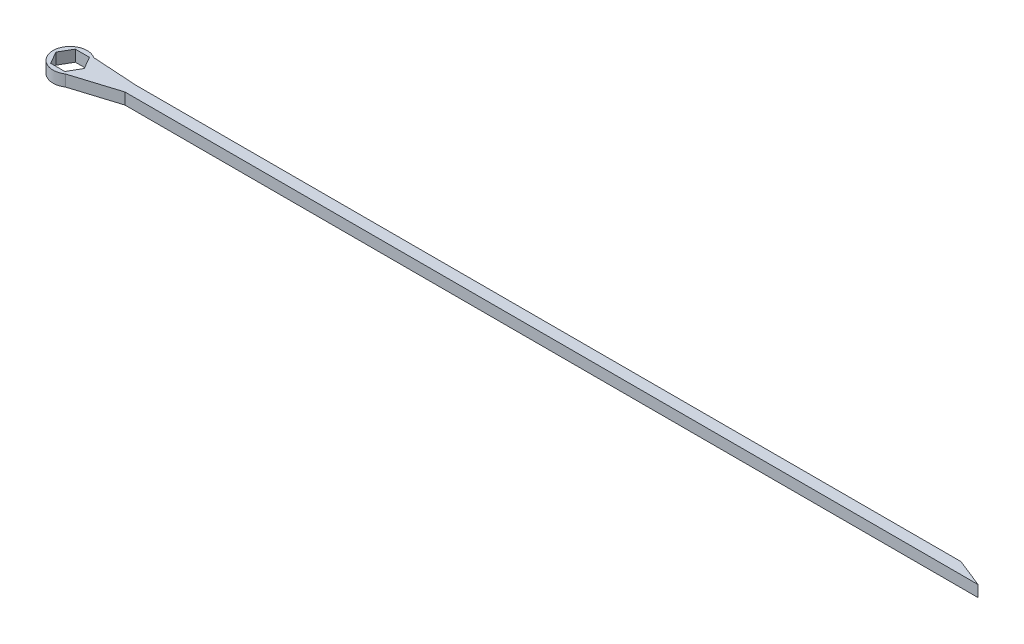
ISO-10303-21;
HEADER;
FILE_DESCRIPTION(('STEP AP214'),'2;1');
FILE_NAME('part.step','',(''),(''),'','','');
FILE_SCHEMA(('AUTOMOTIVE_DESIGN { 1 0 10303 214 1 1 1 1 }'));
ENDSEC;
DATA;
#1=APPLICATION_CONTEXT('core data for automotive mechanical design processes');
#2=APPLICATION_PROTOCOL_DEFINITION('international standard','automotive_design',2000,#1);
#3=PRODUCT_CONTEXT('',#1,'mechanical');
#4=PRODUCT('Part','Part','',(#3));
#5=PRODUCT_RELATED_PRODUCT_CATEGORY('part','',(#4));
#6=PRODUCT_DEFINITION_FORMATION('','',#4);
#7=PRODUCT_DEFINITION_CONTEXT('part definition',#1,'design');
#8=PRODUCT_DEFINITION('design','',#6,#7);
#9=PRODUCT_DEFINITION_SHAPE('','',#8);
#10=(LENGTH_UNIT() NAMED_UNIT(*) SI_UNIT(.MILLI.,.METRE.));
#11=(NAMED_UNIT(*) PLANE_ANGLE_UNIT() SI_UNIT($,.RADIAN.));
#12=(NAMED_UNIT(*) SI_UNIT($,.STERADIAN.) SOLID_ANGLE_UNIT());
#13=UNCERTAINTY_MEASURE_WITH_UNIT(LENGTH_MEASURE(1.E-05),#10,'distance_accuracy_value','');
#14=(GEOMETRIC_REPRESENTATION_CONTEXT(3) GLOBAL_UNCERTAINTY_ASSIGNED_CONTEXT((#13)) GLOBAL_UNIT_ASSIGNED_CONTEXT((#10,
#11,#12)) REPRESENTATION_CONTEXT('',''));
#15=CARTESIAN_POINT('',(0.,0.,0.));
#16=DIRECTION('',(0.,0.,1.));
#17=DIRECTION('',(1.,0.,0.));
#18=AXIS2_PLACEMENT_3D('',#15,#16,#17);
#19=CARTESIAN_POINT('',(0.,1.,0.));
#20=DIRECTION('',(0.,1.,0.));
#21=DIRECTION('',(0.,0.,1.));
#22=AXIS2_PLACEMENT_3D('',#19,#20,#21);
#23=PLANE('',#22);
#24=DIRECTION('',(0.95447997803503,0.,-0.298274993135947));
#25=VECTOR('',#24,1.);
#26=CARTESIAN_POINT('',(4.82915619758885,1.,0.));
#27=LINE('',#26,#25);
#28=CARTESIAN_POINT('',(0.82915619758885,1.,1.25));
#29=VERTEX_POINT('',#28);
#30=CARTESIAN_POINT('',(4.82915619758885,1.,0.));
#31=VERTEX_POINT('',#30);
#32=EDGE_CURVE('E172',#29,#31,#27,.T.);
#33=ORIENTED_EDGE('',*,*,#32,.T.);
#34=DIRECTION('',(1.,0.,0.));
#35=VECTOR('',#34,1.);
#36=CARTESIAN_POINT('',(4.82915619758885,1.,0.));
#37=LINE('',#36,#35);
#38=CARTESIAN_POINT('',(80.,1.,0.));
#39=VERTEX_POINT('',#38);
#40=EDGE_CURVE('E175',#31,#39,#37,.T.);
#41=ORIENTED_EDGE('',*,*,#40,.T.);
#42=DIRECTION('',(-0.928476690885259,0.,-0.371390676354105));
#43=VECTOR('',#42,1.);
#44=CARTESIAN_POINT('',(80.,1.,0.));
#45=LINE('',#44,#43);
#46=CARTESIAN_POINT('',(77.5,1.,-1.00000000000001));
#47=VERTEX_POINT('',#46);
#48=EDGE_CURVE('E178',#39,#47,#45,.T.);
#49=ORIENTED_EDGE('',*,*,#48,.T.);
#50=DIRECTION('',(-1.,0.,0.));
#51=VECTOR('',#50,1.);
#52=CARTESIAN_POINT('',(77.5,1.,-1.00000000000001));
#53=LINE('',#52,#51);
#54=CARTESIAN_POINT('',(4.82915619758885,1.,-0.999999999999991));
#55=VERTEX_POINT('',#54);
#56=EDGE_CURVE('E180',#47,#55,#53,.T.);
#57=ORIENTED_EDGE('',*,*,#56,.T.);
#58=DIRECTION('',(-0.998052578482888,0.,-0.0623782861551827));
#59=VECTOR('',#58,1.);
#60=CARTESIAN_POINT('',(4.82915619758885,1.,-0.999999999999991));
#61=LINE('',#60,#59);
#62=CARTESIAN_POINT('',(0.82915619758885,1.,-1.25));
#63=VERTEX_POINT('',#62);
#64=EDGE_CURVE('E182',#55,#63,#61,.T.);
#65=ORIENTED_EDGE('',*,*,#64,.T.);
#66=CARTESIAN_POINT('',(0.,1.,0.));
#67=DIRECTION('',(0.,1.,0.));
#68=DIRECTION('',(0.,0.,1.));
#69=AXIS2_PLACEMENT_3D('',#66,#67,#68);
#70=CIRCLE('',#69,1.5);
#71=EDGE_CURVE('E184',#63,#29,#70,.T.);
#72=ORIENTED_EDGE('',*,*,#71,.T.);
#73=EDGE_LOOP('',(#33,#41,#49,#57,#65,#72));
#74=FACE_BOUND('',#73,.T.);
#75=DIRECTION('',(-0.5,0.,-0.866025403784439));
#76=VECTOR('',#75,1.);
#77=CARTESIAN_POINT('',(1.25,1.,0.));
#78=LINE('',#77,#76);
#79=CARTESIAN_POINT('',(1.25,1.,0.));
#80=VERTEX_POINT('',#79);
#81=CARTESIAN_POINT('',(0.625,1.,-1.08253175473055));
#82=VERTEX_POINT('',#81);
#83=EDGE_CURVE('E129',#80,#82,#78,.T.);
#84=ORIENTED_EDGE('',*,*,#83,.F.);
#85=DIRECTION('',(0.5,0.,-0.866025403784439));
#86=VECTOR('',#85,1.);
#87=CARTESIAN_POINT('',(0.625,1.,1.08253175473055));
#88=LINE('',#87,#86);
#89=CARTESIAN_POINT('',(0.625,1.,1.08253175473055));
#90=VERTEX_POINT('',#89);
#91=EDGE_CURVE('E121',#90,#80,#88,.T.);
#92=ORIENTED_EDGE('',*,*,#91,.F.);
#93=DIRECTION('',(1.,0.,0.));
#94=VECTOR('',#93,1.);
#95=CARTESIAN_POINT('',(-0.625000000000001,1.,1.08253175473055));
#96=LINE('',#95,#94);
#97=CARTESIAN_POINT('',(-0.625000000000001,1.,1.08253175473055));
#98=VERTEX_POINT('',#97);
#99=EDGE_CURVE('E150',#98,#90,#96,.T.);
#100=ORIENTED_EDGE('',*,*,#99,.F.);
#101=DIRECTION('',(0.5,0.,0.866025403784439));
#102=VECTOR('',#101,1.);
#103=CARTESIAN_POINT('',(-1.25,1.,0.));
#104=LINE('',#103,#102);
#105=CARTESIAN_POINT('',(-1.25,1.,0.));
#106=VERTEX_POINT('',#105);
#107=EDGE_CURVE('E148',#106,#98,#104,.T.);
#108=ORIENTED_EDGE('',*,*,#107,.F.);
#109=DIRECTION('',(-0.5,0.,0.866025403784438));
#110=VECTOR('',#109,1.);
#111=CARTESIAN_POINT('',(-0.625,1.,-1.08253175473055));
#112=LINE('',#111,#110);
#113=CARTESIAN_POINT('',(-0.625,1.,-1.08253175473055));
#114=VERTEX_POINT('',#113);
#115=EDGE_CURVE('E144',#114,#106,#112,.T.);
#116=ORIENTED_EDGE('',*,*,#115,.F.);
#117=DIRECTION('',(-1.,0.,0.));
#118=VECTOR('',#117,1.);
#119=CARTESIAN_POINT('',(0.625,1.,-1.08253175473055));
#120=LINE('',#119,#118);
#121=EDGE_CURVE('E142',#82,#114,#120,.T.);
#122=ORIENTED_EDGE('',*,*,#121,.F.);
#123=EDGE_LOOP('',(#84,#92,#100,#108,#116,#122));
#124=FACE_BOUND('',#123,.T.);
#125=ADVANCED_FACE('F32',(#74,#124),#23,.T.);
#126=CARTESIAN_POINT('',(0.,0.,0.));
#127=DIRECTION('',(0.,1.,0.));
#128=DIRECTION('',(0.,0.,1.));
#129=AXIS2_PLACEMENT_3D('',#126,#127,#128);
#130=PLANE('',#129);
#131=DIRECTION('',(0.95447997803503,0.,-0.298274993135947));
#132=VECTOR('',#131,1.);
#133=CARTESIAN_POINT('',(4.82915619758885,0.,0.));
#134=LINE('',#133,#132);
#135=CARTESIAN_POINT('',(0.82915619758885,0.,1.25));
#136=VERTEX_POINT('',#135);
#137=CARTESIAN_POINT('',(4.82915619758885,0.,0.));
#138=VERTEX_POINT('',#137);
#139=EDGE_CURVE('E137',#136,#138,#134,.T.);
#140=ORIENTED_EDGE('',*,*,#139,.F.);
#141=CARTESIAN_POINT('',(0.,0.,0.));
#142=DIRECTION('',(0.,1.,0.));
#143=DIRECTION('',(0.,0.,1.));
#144=AXIS2_PLACEMENT_3D('',#141,#142,#143);
#145=CIRCLE('',#144,1.5);
#146=CARTESIAN_POINT('',(0.82915619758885,0.,-1.25));
#147=VERTEX_POINT('',#146);
#148=EDGE_CURVE('E176',#147,#136,#145,.T.);
#149=ORIENTED_EDGE('',*,*,#148,.F.);
#150=DIRECTION('',(-0.998052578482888,0.,-0.0623782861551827));
#151=VECTOR('',#150,1.);
#152=CARTESIAN_POINT('',(4.82915619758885,0.,-0.999999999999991));
#153=LINE('',#152,#151);
#154=CARTESIAN_POINT('',(4.82915619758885,0.,-0.999999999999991));
#155=VERTEX_POINT('',#154);
#156=EDGE_CURVE('E195',#155,#147,#153,.T.);
#157=ORIENTED_EDGE('',*,*,#156,.F.);
#158=DIRECTION('',(-1.,0.,0.));
#159=VECTOR('',#158,1.);
#160=CARTESIAN_POINT('',(77.5,0.,-1.00000000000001));
#161=LINE('',#160,#159);
#162=CARTESIAN_POINT('',(77.5,0.,-1.00000000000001));
#163=VERTEX_POINT('',#162);
#164=EDGE_CURVE('E193',#163,#155,#161,.T.);
#165=ORIENTED_EDGE('',*,*,#164,.F.);
#166=DIRECTION('',(-0.928476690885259,0.,-0.371390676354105));
#167=VECTOR('',#166,1.);
#168=CARTESIAN_POINT('',(80.,0.,0.));
#169=LINE('',#168,#167);
#170=CARTESIAN_POINT('',(80.,0.,0.));
#171=VERTEX_POINT('',#170);
#172=EDGE_CURVE('E191',#171,#163,#169,.T.);
#173=ORIENTED_EDGE('',*,*,#172,.F.);
#174=DIRECTION('',(1.,0.,0.));
#175=VECTOR('',#174,1.);
#176=CARTESIAN_POINT('',(4.82915619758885,0.,0.));
#177=LINE('',#176,#175);
#178=EDGE_CURVE('E189',#138,#171,#177,.T.);
#179=ORIENTED_EDGE('',*,*,#178,.F.);
#180=EDGE_LOOP('',(#140,#149,#157,#165,#173,#179));
#181=FACE_BOUND('',#180,.T.);
#182=DIRECTION('',(0.5,0.,-0.866025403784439));
#183=VECTOR('',#182,1.);
#184=CARTESIAN_POINT('',(0.625,0.,1.08253175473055));
#185=LINE('',#184,#183);
#186=CARTESIAN_POINT('',(0.625,0.,1.08253175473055));
#187=VERTEX_POINT('',#186);
#188=CARTESIAN_POINT('',(1.25,0.,0.));
#189=VERTEX_POINT('',#188);
#190=EDGE_CURVE('E55',#187,#189,#185,.T.);
#191=ORIENTED_EDGE('',*,*,#190,.T.);
#192=DIRECTION('',(-0.5,0.,-0.866025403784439));
#193=VECTOR('',#192,1.);
#194=CARTESIAN_POINT('',(1.25,0.,0.));
#195=LINE('',#194,#193);
#196=CARTESIAN_POINT('',(0.625,0.,-1.08253175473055));
#197=VERTEX_POINT('',#196);
#198=EDGE_CURVE('E136',#189,#197,#195,.T.);
#199=ORIENTED_EDGE('',*,*,#198,.T.);
#200=DIRECTION('',(-1.,0.,0.));
#201=VECTOR('',#200,1.);
#202=CARTESIAN_POINT('',(0.625,0.,-1.08253175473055));
#203=LINE('',#202,#201);
#204=CARTESIAN_POINT('',(-0.625,0.,-1.08253175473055));
#205=VERTEX_POINT('',#204);
#206=EDGE_CURVE('E154',#197,#205,#203,.T.);
#207=ORIENTED_EDGE('',*,*,#206,.T.);
#208=DIRECTION('',(-0.5,0.,0.866025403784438));
#209=VECTOR('',#208,1.);
#210=CARTESIAN_POINT('',(-0.625,0.,-1.08253175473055));
#211=LINE('',#210,#209);
#212=CARTESIAN_POINT('',(-1.25,0.,0.));
#213=VERTEX_POINT('',#212);
#214=EDGE_CURVE('E157',#205,#213,#211,.T.);
#215=ORIENTED_EDGE('',*,*,#214,.T.);
#216=DIRECTION('',(0.5,0.,0.866025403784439));
#217=VECTOR('',#216,1.);
#218=CARTESIAN_POINT('',(-1.25,0.,0.));
#219=LINE('',#218,#217);
#220=CARTESIAN_POINT('',(-0.625000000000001,0.,1.08253175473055));
#221=VERTEX_POINT('',#220);
#222=EDGE_CURVE('E160',#213,#221,#219,.T.);
#223=ORIENTED_EDGE('',*,*,#222,.T.);
#224=DIRECTION('',(1.,0.,0.));
#225=VECTOR('',#224,1.);
#226=CARTESIAN_POINT('',(-0.625000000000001,0.,1.08253175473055));
#227=LINE('',#226,#225);
#228=EDGE_CURVE('E130',#221,#187,#227,.T.);
#229=ORIENTED_EDGE('',*,*,#228,.T.);
#230=EDGE_LOOP('',(#191,#199,#207,#215,#223,#229));
#231=FACE_BOUND('',#230,.T.);
#232=ADVANCED_FACE('F219',(#181,#231),#130,.F.);
#233=CARTESIAN_POINT('',(4.82915619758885,1.,0.));
#234=DIRECTION('',(-0.298274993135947,0.,-0.95447997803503));
#235=DIRECTION('',(-0.95447997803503,0.,0.298274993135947));
#236=AXIS2_PLACEMENT_3D('',#233,#234,#235);
#237=PLANE('',#236);
#238=ORIENTED_EDGE('',*,*,#139,.T.);
#239=DIRECTION('',(0.,-1.,0.));
#240=VECTOR('',#239,1.);
#241=CARTESIAN_POINT('',(4.82915619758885,1.,0.));
#242=LINE('',#241,#240);
#243=EDGE_CURVE('E11',#31,#138,#242,.T.);
#244=ORIENTED_EDGE('',*,*,#243,.F.);
#245=ORIENTED_EDGE('',*,*,#32,.F.);
#246=DIRECTION('',(0.,-1.,0.));
#247=VECTOR('',#246,1.);
#248=CARTESIAN_POINT('',(0.82915619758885,1.,1.25));
#249=LINE('',#248,#247);
#250=EDGE_CURVE('E186',#29,#136,#249,.T.);
#251=ORIENTED_EDGE('',*,*,#250,.T.);
#252=EDGE_LOOP('',(#238,#244,#245,#251));
#253=FACE_BOUND('',#252,.T.);
#254=ADVANCED_FACE('F34',(#253),#237,.F.);
#255=CARTESIAN_POINT('',(4.82915619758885,1.,0.));
#256=DIRECTION('',(0.,0.,-1.));
#257=DIRECTION('',(-1.,0.,0.));
#258=AXIS2_PLACEMENT_3D('',#255,#256,#257);
#259=PLANE('',#258);
#260=ORIENTED_EDGE('',*,*,#178,.T.);
#261=DIRECTION('',(0.,-1.,0.));
#262=VECTOR('',#261,1.);
#263=CARTESIAN_POINT('',(80.,1.,0.));
#264=LINE('',#263,#262);
#265=EDGE_CURVE('E40',#39,#171,#264,.T.);
#266=ORIENTED_EDGE('',*,*,#265,.F.);
#267=ORIENTED_EDGE('',*,*,#40,.F.);
#268=ORIENTED_EDGE('',*,*,#243,.T.);
#269=EDGE_LOOP('',(#260,#266,#267,#268));
#270=FACE_BOUND('',#269,.T.);
#271=ADVANCED_FACE('F236',(#270),#259,.F.);
#272=CARTESIAN_POINT('',(80.,1.,0.));
#273=DIRECTION('',(-0.371390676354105,0.,0.928476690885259));
#274=DIRECTION('',(0.928476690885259,0.,0.371390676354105));
#275=AXIS2_PLACEMENT_3D('',#272,#273,#274);
#276=PLANE('',#275);
#277=ORIENTED_EDGE('',*,*,#172,.T.);
#278=DIRECTION('',(0.,-1.,0.));
#279=VECTOR('',#278,1.);
#280=CARTESIAN_POINT('',(77.5,1.,-1.00000000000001));
#281=LINE('',#280,#279);
#282=EDGE_CURVE('E206',#47,#163,#281,.T.);
#283=ORIENTED_EDGE('',*,*,#282,.F.);
#284=ORIENTED_EDGE('',*,*,#48,.F.);
#285=ORIENTED_EDGE('',*,*,#265,.T.);
#286=EDGE_LOOP('',(#277,#283,#284,#285));
#287=FACE_BOUND('',#286,.T.);
#288=ADVANCED_FACE('F213',(#287),#276,.F.);
#289=CARTESIAN_POINT('',(77.5,1.,-1.00000000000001));
#290=DIRECTION('',(0.,0.,1.));
#291=DIRECTION('',(1.,0.,0.));
#292=AXIS2_PLACEMENT_3D('',#289,#290,#291);
#293=PLANE('',#292);
#294=ORIENTED_EDGE('',*,*,#164,.T.);
#295=DIRECTION('',(0.,-1.,0.));
#296=VECTOR('',#295,1.);
#297=CARTESIAN_POINT('',(4.82915619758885,1.,-0.999999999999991));
#298=LINE('',#297,#296);
#299=EDGE_CURVE('E203',#55,#155,#298,.T.);
#300=ORIENTED_EDGE('',*,*,#299,.F.);
#301=ORIENTED_EDGE('',*,*,#56,.F.);
#302=ORIENTED_EDGE('',*,*,#282,.T.);
#303=EDGE_LOOP('',(#294,#300,#301,#302));
#304=FACE_BOUND('',#303,.T.);
#305=ADVANCED_FACE('F225',(#304),#293,.F.);
#306=CARTESIAN_POINT('',(4.82915619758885,1.,-0.999999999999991));
#307=DIRECTION('',(-0.0623782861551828,0.,0.998052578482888));
#308=DIRECTION('',(0.998052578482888,0.,0.0623782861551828));
#309=AXIS2_PLACEMENT_3D('',#306,#307,#308);
#310=PLANE('',#309);
#311=ORIENTED_EDGE('',*,*,#156,.T.);
#312=DIRECTION('',(0.,-1.,0.));
#313=VECTOR('',#312,1.);
#314=CARTESIAN_POINT('',(0.82915619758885,1.,-1.25));
#315=LINE('',#314,#313);
#316=EDGE_CURVE('E200',#63,#147,#315,.T.);
#317=ORIENTED_EDGE('',*,*,#316,.F.);
#318=ORIENTED_EDGE('',*,*,#64,.F.);
#319=ORIENTED_EDGE('',*,*,#299,.T.);
#320=EDGE_LOOP('',(#311,#317,#318,#319));
#321=FACE_BOUND('',#320,.T.);
#322=ADVANCED_FACE('F229',(#321),#310,.F.);
#323=CARTESIAN_POINT('',(0.,1.,0.));
#324=DIRECTION('',(0.,-1.,0.));
#325=DIRECTION('',(0.,0.,-1.));
#326=AXIS2_PLACEMENT_3D('',#323,#324,#325);
#327=CYLINDRICAL_SURFACE('',#326,1.5);
#328=ORIENTED_EDGE('',*,*,#148,.T.);
#329=ORIENTED_EDGE('',*,*,#250,.F.);
#330=ORIENTED_EDGE('',*,*,#71,.F.);
#331=ORIENTED_EDGE('',*,*,#316,.T.);
#332=EDGE_LOOP('',(#328,#329,#330,#331));
#333=FACE_BOUND('',#332,.T.);
#334=ADVANCED_FACE('F239',(#333),#327,.T.);
#335=CARTESIAN_POINT('',(0.625,1.,1.08253175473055));
#336=DIRECTION('',(-0.866025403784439,0.,-0.5));
#337=DIRECTION('',(-0.5,0.,0.866025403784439));
#338=AXIS2_PLACEMENT_3D('',#335,#336,#337);
#339=PLANE('',#338);
#340=ORIENTED_EDGE('',*,*,#190,.F.);
#341=DIRECTION('',(0.,-1.,0.));
#342=VECTOR('',#341,1.);
#343=CARTESIAN_POINT('',(0.625,1.,1.08253175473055));
#344=LINE('',#343,#342);
#345=EDGE_CURVE('E125',#90,#187,#344,.T.);
#346=ORIENTED_EDGE('',*,*,#345,.F.);
#347=ORIENTED_EDGE('',*,*,#91,.T.);
#348=DIRECTION('',(0.,-1.,0.));
#349=VECTOR('',#348,1.);
#350=CARTESIAN_POINT('',(1.25,1.,0.));
#351=LINE('',#350,#349);
#352=EDGE_CURVE('E124',#80,#189,#351,.T.);
#353=ORIENTED_EDGE('',*,*,#352,.T.);
#354=EDGE_LOOP('',(#340,#346,#347,#353));
#355=FACE_BOUND('',#354,.T.);
#356=ADVANCED_FACE('F123',(#355),#339,.T.);
#357=CARTESIAN_POINT('',(1.25,1.,0.));
#358=DIRECTION('',(-0.866025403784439,0.,0.5));
#359=DIRECTION('',(0.5,0.,0.866025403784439));
#360=AXIS2_PLACEMENT_3D('',#357,#358,#359);
#361=PLANE('',#360);
#362=ORIENTED_EDGE('',*,*,#198,.F.);
#363=ORIENTED_EDGE('',*,*,#352,.F.);
#364=ORIENTED_EDGE('',*,*,#83,.T.);
#365=DIRECTION('',(0.,-1.,0.));
#366=VECTOR('',#365,1.);
#367=CARTESIAN_POINT('',(0.625,1.,-1.08253175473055));
#368=LINE('',#367,#366);
#369=EDGE_CURVE('E138',#82,#197,#368,.T.);
#370=ORIENTED_EDGE('',*,*,#369,.T.);
#371=EDGE_LOOP('',(#362,#363,#364,#370));
#372=FACE_BOUND('',#371,.T.);
#373=ADVANCED_FACE('F133',(#372),#361,.T.);
#374=CARTESIAN_POINT('',(0.625,1.,-1.08253175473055));
#375=DIRECTION('',(0.,0.,1.));
#376=DIRECTION('',(1.,0.,0.));
#377=AXIS2_PLACEMENT_3D('',#374,#375,#376);
#378=PLANE('',#377);
#379=ORIENTED_EDGE('',*,*,#206,.F.);
#380=ORIENTED_EDGE('',*,*,#369,.F.);
#381=ORIENTED_EDGE('',*,*,#121,.T.);
#382=DIRECTION('',(0.,-1.,0.));
#383=VECTOR('',#382,1.);
#384=CARTESIAN_POINT('',(-0.625,1.,-1.08253175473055));
#385=LINE('',#384,#383);
#386=EDGE_CURVE('E169',#114,#205,#385,.T.);
#387=ORIENTED_EDGE('',*,*,#386,.T.);
#388=EDGE_LOOP('',(#379,#380,#381,#387));
#389=FACE_BOUND('',#388,.T.);
#390=ADVANCED_FACE('F257',(#389),#378,.T.);
#391=CARTESIAN_POINT('',(-0.625,1.,-1.08253175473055));
#392=DIRECTION('',(0.866025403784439,0.,0.5));
#393=DIRECTION('',(0.5,0.,-0.866025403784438));
#394=AXIS2_PLACEMENT_3D('',#391,#392,#393);
#395=PLANE('',#394);
#396=ORIENTED_EDGE('',*,*,#214,.F.);
#397=ORIENTED_EDGE('',*,*,#386,.F.);
#398=ORIENTED_EDGE('',*,*,#115,.T.);
#399=DIRECTION('',(0.,-1.,0.));
#400=VECTOR('',#399,1.);
#401=CARTESIAN_POINT('',(-1.25,1.,0.));
#402=LINE('',#401,#400);
#403=EDGE_CURVE('E167',#106,#213,#402,.T.);
#404=ORIENTED_EDGE('',*,*,#403,.T.);
#405=EDGE_LOOP('',(#396,#397,#398,#404));
#406=FACE_BOUND('',#405,.T.);
#407=ADVANCED_FACE('F260',(#406),#395,.T.);
#408=CARTESIAN_POINT('',(-1.25,1.,0.));
#409=DIRECTION('',(0.866025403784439,0.,-0.5));
#410=DIRECTION('',(-0.5,0.,-0.866025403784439));
#411=AXIS2_PLACEMENT_3D('',#408,#409,#410);
#412=PLANE('',#411);
#413=ORIENTED_EDGE('',*,*,#222,.F.);
#414=ORIENTED_EDGE('',*,*,#403,.F.);
#415=ORIENTED_EDGE('',*,*,#107,.T.);
#416=DIRECTION('',(0.,-1.,0.));
#417=VECTOR('',#416,1.);
#418=CARTESIAN_POINT('',(-0.625000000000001,1.,1.08253175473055));
#419=LINE('',#418,#417);
#420=EDGE_CURVE('E47',#98,#221,#419,.T.);
#421=ORIENTED_EDGE('',*,*,#420,.T.);
#422=EDGE_LOOP('',(#413,#414,#415,#421));
#423=FACE_BOUND('',#422,.T.);
#424=ADVANCED_FACE('F264',(#423),#412,.T.);
#425=CARTESIAN_POINT('',(-0.625000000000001,1.,1.08253175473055));
#426=DIRECTION('',(0.,0.,-1.));
#427=DIRECTION('',(-1.,0.,0.));
#428=AXIS2_PLACEMENT_3D('',#425,#426,#427);
#429=PLANE('',#428);
#430=ORIENTED_EDGE('',*,*,#228,.F.);
#431=ORIENTED_EDGE('',*,*,#420,.F.);
#432=ORIENTED_EDGE('',*,*,#99,.T.);
#433=ORIENTED_EDGE('',*,*,#345,.T.);
#434=EDGE_LOOP('',(#430,#431,#432,#433));
#435=FACE_BOUND('',#434,.T.);
#436=ADVANCED_FACE('F268',(#435),#429,.T.);
#437=CLOSED_SHELL('',(#125,#232,#254,#271,#288,#305,#322,#334,#356,#373,#390,#407,#424,#436));
#438=MANIFOLD_SOLID_BREP('B2',#437);
#439=ADVANCED_BREP_SHAPE_REPRESENTATION('',(#18,#438),#14);
#440=SHAPE_DEFINITION_REPRESENTATION(#9,#439);
ENDSEC;
END-ISO-10303-21;
